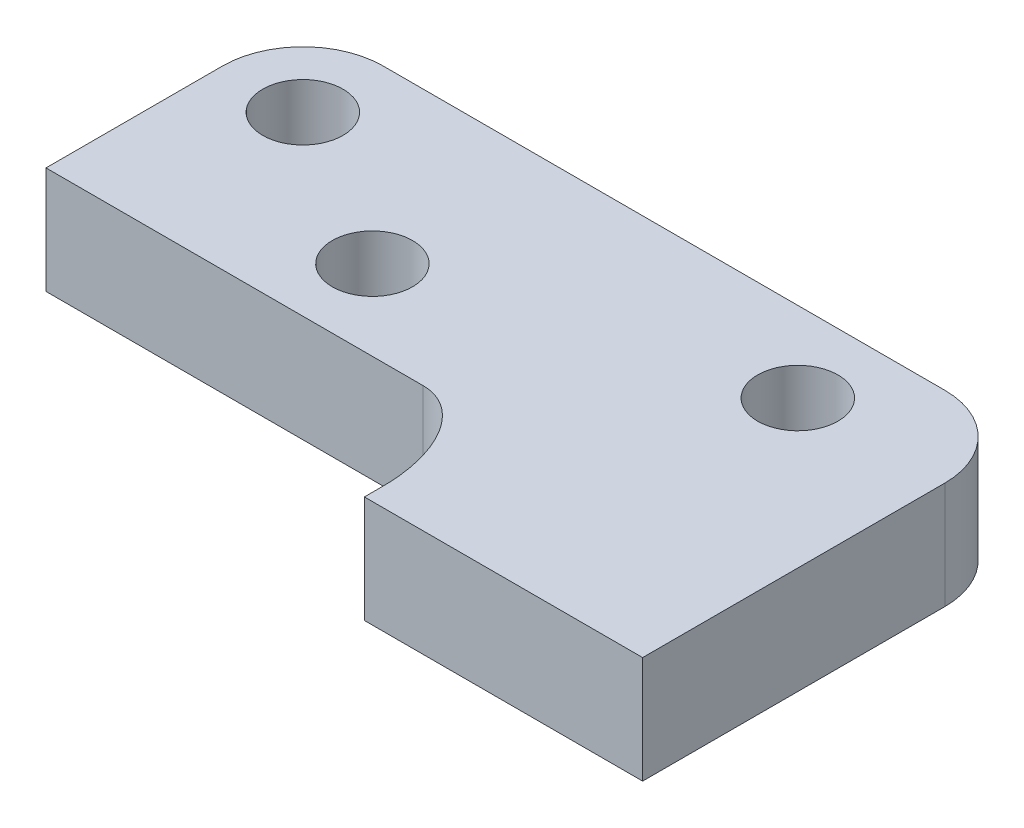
ISO-10303-21;
HEADER;
FILE_DESCRIPTION(('STEP AP214'),'2;1');
FILE_NAME('part.step','',(''),(''),'','','');
FILE_SCHEMA(('AUTOMOTIVE_DESIGN { 1 0 10303 214 1 1 1 1 }'));
ENDSEC;
DATA;
#1=APPLICATION_CONTEXT('core data for automotive mechanical design processes');
#2=APPLICATION_PROTOCOL_DEFINITION('international standard','automotive_design',2000,#1);
#3=PRODUCT_CONTEXT('',#1,'mechanical');
#4=PRODUCT('Part','Part','',(#3));
#5=PRODUCT_RELATED_PRODUCT_CATEGORY('part','',(#4));
#6=PRODUCT_DEFINITION_FORMATION('','',#4);
#7=PRODUCT_DEFINITION_CONTEXT('part definition',#1,'design');
#8=PRODUCT_DEFINITION('design','',#6,#7);
#9=PRODUCT_DEFINITION_SHAPE('','',#8);
#10=(LENGTH_UNIT() NAMED_UNIT(*) SI_UNIT(.MILLI.,.METRE.));
#11=(NAMED_UNIT(*) PLANE_ANGLE_UNIT() SI_UNIT($,.RADIAN.));
#12=(NAMED_UNIT(*) SI_UNIT($,.STERADIAN.) SOLID_ANGLE_UNIT());
#13=UNCERTAINTY_MEASURE_WITH_UNIT(LENGTH_MEASURE(1.E-05),#10,'distance_accuracy_value','');
#14=(GEOMETRIC_REPRESENTATION_CONTEXT(3) GLOBAL_UNCERTAINTY_ASSIGNED_CONTEXT((#13)) GLOBAL_UNIT_ASSIGNED_CONTEXT((#10,
#11,#12)) REPRESENTATION_CONTEXT('',''));
#15=CARTESIAN_POINT('',(0.,0.,0.));
#16=DIRECTION('',(0.,0.,1.));
#17=DIRECTION('',(1.,0.,0.));
#18=AXIS2_PLACEMENT_3D('',#15,#16,#17);
#19=CARTESIAN_POINT('',(4.35,-2.,-1.125));
#20=DIRECTION('',(-1.,0.,0.));
#21=DIRECTION('',(0.,0.,1.));
#22=AXIS2_PLACEMENT_3D('',#19,#20,#21);
#23=PLANE('',#22);
#24=CARTESIAN_POINT('',(4.35008091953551,-2.,-1.12499989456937));
#25=DIRECTION('',(0.,1.,0.));
#26=VECTOR('',#25,1.);
#27=LINE('',#24,#26);
#28=CARTESIAN_POINT('',(4.35004045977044,2.,-1.12499994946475));
#29=VERTEX_POINT('',#28);
#30=CARTESIAN_POINT('',(4.35004045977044,-2.,-1.12499994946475));
#31=VERTEX_POINT('',#30);
#32=EDGE_CURVE('E133',#29,#31,#27,.F.);
#33=ORIENTED_EDGE('',*,*,#32,.T.);
#34=DIRECTION('',(0.,0.,1.));
#35=VECTOR('',#34,1.);
#36=CARTESIAN_POINT('',(4.35,-2.,0.));
#37=LINE('',#36,#35);
#38=CARTESIAN_POINT('',(4.35,-2.,-0.425));
#39=VERTEX_POINT('',#38);
#40=EDGE_CURVE('E247',#31,#39,#37,.T.);
#41=ORIENTED_EDGE('',*,*,#40,.T.);
#42=DIRECTION('',(0.,1.,0.));
#43=VECTOR('',#42,1.);
#44=CARTESIAN_POINT('',(4.35,-2.,-0.425));
#45=LINE('',#44,#43);
#46=CARTESIAN_POINT('',(4.35,2.,-0.425));
#47=VERTEX_POINT('',#46);
#48=EDGE_CURVE('E131',#47,#39,#45,.F.);
#49=ORIENTED_EDGE('',*,*,#48,.F.);
#50=DIRECTION('',(0.,0.,1.));
#51=VECTOR('',#50,1.);
#52=CARTESIAN_POINT('',(4.35,2.,-1.125));
#53=LINE('',#52,#51);
#54=EDGE_CURVE('E100',#47,#29,#53,.F.);
#55=ORIENTED_EDGE('',*,*,#54,.T.);
#56=EDGE_LOOP('',(#33,#41,#49,#55));
#57=FACE_BOUND('',#56,.T.);
#58=ADVANCED_FACE('F17',(#57),#23,.T.);
#59=CARTESIAN_POINT('',(0.,-2.,0.));
#60=DIRECTION('',(0.,1.,0.));
#61=DIRECTION('',(0.,0.,1.));
#62=AXIS2_PLACEMENT_3D('',#59,#60,#61);
#63=PLANE('',#62);
#64=CARTESIAN_POINT('',(-3.05,-2.,-8.125));
#65=DIRECTION('',(0.,1.,0.));
#66=DIRECTION('',(0.,0.,1.));
#67=AXIS2_PLACEMENT_3D('',#64,#65,#66);
#68=CIRCLE('',#67,1.5);
#69=CARTESIAN_POINT('',(-3.05,-2.,-6.625));
#70=VERTEX_POINT('',#69);
#71=EDGE_CURVE('E221',#70,#70,#68,.T.);
#72=ORIENTED_EDGE('',*,*,#71,.T.);
#73=EDGE_LOOP('',(#72));
#74=FACE_BOUND('',#73,.T.);
#75=CARTESIAN_POINT('',(-9.25,-2.,-11.725));
#76=DIRECTION('',(0.,1.,0.));
#77=DIRECTION('',(0.,0.,1.));
#78=AXIS2_PLACEMENT_3D('',#75,#76,#77);
#79=CIRCLE('',#78,1.5);
#80=CARTESIAN_POINT('',(-9.25,-2.,-10.225));
#81=VERTEX_POINT('',#80);
#82=EDGE_CURVE('E368',#81,#81,#79,.T.);
#83=ORIENTED_EDGE('',*,*,#82,.T.);
#84=EDGE_LOOP('',(#83));
#85=FACE_BOUND('',#84,.T.);
#86=CARTESIAN_POINT('',(9.25,-2.,-11.725));
#87=DIRECTION('',(0.,1.,0.));
#88=DIRECTION('',(0.,0.,1.));
#89=AXIS2_PLACEMENT_3D('',#86,#87,#88);
#90=CIRCLE('',#89,1.5);
#91=CARTESIAN_POINT('',(9.25,-2.,-10.225));
#92=VERTEX_POINT('',#91);
#93=EDGE_CURVE('E267',#92,#92,#90,.T.);
#94=ORIENTED_EDGE('',*,*,#93,.T.);
#95=EDGE_LOOP('',(#94));
#96=FACE_BOUND('',#95,.T.);
#97=CARTESIAN_POINT('',(11.75,-2.,-11.725));
#98=DIRECTION('',(0.,1.,0.));
#99=DIRECTION('',(0.,0.,1.));
#100=AXIS2_PLACEMENT_3D('',#97,#98,#99);
#101=CIRCLE('',#100,3.);
#102=CARTESIAN_POINT('',(14.75,-2.,-11.725));
#103=VERTEX_POINT('',#102);
#104=CARTESIAN_POINT('',(11.75,-2.,-14.725));
#105=VERTEX_POINT('',#104);
#106=EDGE_CURVE('E233',#103,#105,#101,.T.);
#107=ORIENTED_EDGE('',*,*,#106,.F.);
#108=DIRECTION('',(0.,0.,-1.));
#109=VECTOR('',#108,1.);
#110=CARTESIAN_POINT('',(14.75,-2.,-0.425));
#111=LINE('',#110,#109);
#112=CARTESIAN_POINT('',(14.75,-2.,-0.425));
#113=VERTEX_POINT('',#112);
#114=EDGE_CURVE('E66',#113,#103,#111,.T.);
#115=ORIENTED_EDGE('',*,*,#114,.F.);
#116=DIRECTION('',(1.,0.,0.));
#117=VECTOR('',#116,1.);
#118=CARTESIAN_POINT('',(4.35,-2.,-0.425));
#119=LINE('',#118,#117);
#120=EDGE_CURVE('E76',#39,#113,#119,.T.);
#121=ORIENTED_EDGE('',*,*,#120,.F.);
#122=ORIENTED_EDGE('',*,*,#40,.F.);
#123=CARTESIAN_POINT('',(4.35008091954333,-2.,-1.12499990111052));
#124=CARTESIAN_POINT('',(4.35023973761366,-2.,-1.23796661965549));
#125=CARTESIAN_POINT('',(4.34750347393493,-2.,-1.35095608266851));
#126=CARTESIAN_POINT('',(4.33593330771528,-2.,-1.57684698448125));
#127=CARTESIAN_POINT('',(4.3270871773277,-2.,-1.68974779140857));
#128=CARTESIAN_POINT('',(4.30297655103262,-2.,-1.91496686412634));
#129=CARTESIAN_POINT('',(4.28770662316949,-2.,-2.0272845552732));
#130=CARTESIAN_POINT('',(4.25043635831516,-2.,-2.2521243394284));
#131=CARTESIAN_POINT('',(4.22836053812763,-2.,-2.36463389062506));
#132=CARTESIAN_POINT('',(4.17783080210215,-2.,-2.58814748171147));
#133=CARTESIAN_POINT('',(4.14938040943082,-2.,-2.69915231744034));
#134=CARTESIAN_POINT('',(4.08563637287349,-2.,-2.91911271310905));
#135=CARTESIAN_POINT('',(4.05034781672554,-2.,-3.02806973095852));
#136=CARTESIAN_POINT('',(3.97883042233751,-2.,-3.2252143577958));
#137=CARTESIAN_POINT('',(3.94375305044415,-2.,-3.3138190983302));
#138=CARTESIAN_POINT('',(3.86809085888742,-2.,-3.48865455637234));
#139=CARTESIAN_POINT('',(3.82750617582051,-2.,-3.57488533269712));
#140=CARTESIAN_POINT('',(3.74074328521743,-2.,-3.74420870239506));
#141=CARTESIAN_POINT('',(3.69458013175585,-2.,-3.82730898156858));
#142=CARTESIAN_POINT('',(3.59616160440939,-2.,-3.98982623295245));
#143=CARTESIAN_POINT('',(3.54390782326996,-2.,-4.06924416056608));
#144=CARTESIAN_POINT('',(3.44688591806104,-2.,-4.20392254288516));
#145=CARTESIAN_POINT('',(3.40355743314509,-2.,-4.26022083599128));
#146=CARTESIAN_POINT('',(3.31311905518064,-2.,-4.3696807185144));
#147=CARTESIAN_POINT('',(3.26601031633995,-2.,-4.42284325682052));
#148=CARTESIAN_POINT('',(3.16784943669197,-2.,-4.52534941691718));
#149=CARTESIAN_POINT('',(3.11680031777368,-2.,-4.57469590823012));
#150=CARTESIAN_POINT('',(3.03729013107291,-2.,-4.64538077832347));
#151=CARTESIAN_POINT('',(3.01029784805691,-2.,-4.66838619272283));
#152=CARTESIAN_POINT('',(2.95534563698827,-2.,-4.71321048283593));
#153=CARTESIAN_POINT('',(2.92738576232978,-2.,-4.73502942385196));
#154=CARTESIAN_POINT('',(2.85714472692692,-2.,-4.78719568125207));
#155=CARTESIAN_POINT('',(2.81427777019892,-2.,-4.81676275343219));
#156=CARTESIAN_POINT('',(2.72638479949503,-2.,-4.87248754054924));
#157=CARTESIAN_POINT('',(2.68135917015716,-2.,-4.89864585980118));
#158=CARTESIAN_POINT('',(2.58942071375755,-2.,-4.94710030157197));
#159=CARTESIAN_POINT('',(2.54251303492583,-2.,-4.96940617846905));
#160=CARTESIAN_POINT('',(2.44699524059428,-2.,-5.01003523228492));
#161=CARTESIAN_POINT('',(2.39838513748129,-2.,-5.02835843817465));
#162=CARTESIAN_POINT('',(2.30895155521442,-2.,-5.05749170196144));
#163=CARTESIAN_POINT('',(2.26837795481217,-2.,-5.06906635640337));
#164=CARTESIAN_POINT('',(2.20695277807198,-2.,-5.08409727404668));
#165=CARTESIAN_POINT('',(2.18638059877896,-2.,-5.08871956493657));
#166=CARTESIAN_POINT('',(2.14507698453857,-2.,-5.09719370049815));
#167=CARTESIAN_POINT('',(2.12434554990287,-2.,-5.1010455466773));
#168=CARTESIAN_POINT('',(2.08261108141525,-2.,-5.10794518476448));
#169=CARTESIAN_POINT('',(2.06160715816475,-2.,-5.11098761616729));
#170=CARTESIAN_POINT('',(2.01949081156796,-2.,-5.11619452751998));
#171=CARTESIAN_POINT('',(1.99837839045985,-2.,-5.11835902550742));
#172=CARTESIAN_POINT('',(1.95607311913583,-2.,-5.12179700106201));
#173=CARTESIAN_POINT('',(1.9348802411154,-2.,-5.12307013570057));
#174=CARTESIAN_POINT('',(1.89245768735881,-2.,-5.12473624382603));
#175=CARTESIAN_POINT('',(1.87122800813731,-2.,-5.12512912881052));
#176=CARTESIAN_POINT('',(1.84999984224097,-2.,-5.12508786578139));
#177=B_SPLINE_CURVE_WITH_KNOTS('',3,(#123,#124,#125,#126,#127,#128,#129,#130,#131,#132,#133,
#134,#135,#136,#137,#138,#139,#140,#141,#142,#143,#144,#145,#146,#147,#148,#149,#150,#151,#152,
#153,#154,#155,#156,#157,#158,#159,#160,#161,#162,#163,#164,#165,#166,#167,#168,#169,#170,#171,
#172,#173,#174,#175,#176),.UNSPECIFIED.,.F.,.F.,(4,2,2,2,2,2,2,2,2,2,2,2,2,2,2,2,2,2,2,2,2,2,2,
2,2,2,4),(0.,0.338891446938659,0.678463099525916,1.01832247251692,1.3620957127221,
1.70567941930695,2.04900846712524,2.33472494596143,2.62043433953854,2.90538924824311,
3.19026980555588,3.40324421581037,3.61615384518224,3.82890178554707,3.93527178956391,
4.04163593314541,4.19771271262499,4.35376178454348,4.5094097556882,4.66505659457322,
4.79150591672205,4.85474872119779,4.91799140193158,4.98164304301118,5.04529337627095,
5.10896818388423,5.17264939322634),.UNSPECIFIED.);
#178=CARTESIAN_POINT('',(1.8499999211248,-2.,-5.1250439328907));
#179=VERTEX_POINT('',#178);
#180=EDGE_CURVE('E198',#31,#179,#177,.T.);
#181=ORIENTED_EDGE('',*,*,#180,.T.);
#182=DIRECTION('',(1.,0.,0.));
#183=VECTOR('',#182,1.);
#184=CARTESIAN_POINT('',(-12.25,-2.,-5.125));
#185=LINE('',#184,#183);
#186=CARTESIAN_POINT('',(-12.25,-2.,-5.125));
#187=VERTEX_POINT('',#186);
#188=EDGE_CURVE('E191',#187,#179,#185,.T.);
#189=ORIENTED_EDGE('',*,*,#188,.F.);
#190=DIRECTION('',(0.,0.,1.));
#191=VECTOR('',#190,1.);
#192=CARTESIAN_POINT('',(-12.25,-2.,-11.725));
#193=LINE('',#192,#191);
#194=CARTESIAN_POINT('',(-12.25,-2.,-11.725));
#195=VERTEX_POINT('',#194);
#196=EDGE_CURVE('E253',#195,#187,#193,.T.);
#197=ORIENTED_EDGE('',*,*,#196,.F.);
#198=CARTESIAN_POINT('',(-9.25,-2.,-11.725));
#199=DIRECTION('',(0.,1.,0.));
#200=DIRECTION('',(0.,0.,1.));
#201=AXIS2_PLACEMENT_3D('',#198,#199,#200);
#202=CIRCLE('',#201,3.);
#203=CARTESIAN_POINT('',(-9.25,-2.,-14.725));
#204=VERTEX_POINT('',#203);
#205=EDGE_CURVE('E229',#204,#195,#202,.T.);
#206=ORIENTED_EDGE('',*,*,#205,.F.);
#207=DIRECTION('',(-1.,0.,0.));
#208=VECTOR('',#207,1.);
#209=CARTESIAN_POINT('',(11.75,-2.,-14.725));
#210=LINE('',#209,#208);
#211=EDGE_CURVE('E227',#105,#204,#210,.T.);
#212=ORIENTED_EDGE('',*,*,#211,.F.);
#213=EDGE_LOOP('',(#107,#115,#121,#122,#181,#189,#197,#206,#212));
#214=FACE_BOUND('',#213,.T.);
#215=ADVANCED_FACE('F265',(#74,#85,#96,#214),#63,.F.);
#216=CARTESIAN_POINT('',(-12.25,-2.,-11.725));
#217=DIRECTION('',(-1.,0.,0.));
#218=DIRECTION('',(0.,0.,1.));
#219=AXIS2_PLACEMENT_3D('',#216,#217,#218);
#220=PLANE('',#219);
#221=DIRECTION('',(0.,1.,0.));
#222=VECTOR('',#221,1.);
#223=CARTESIAN_POINT('',(-12.25,-2.,-11.725));
#224=LINE('',#223,#222);
#225=CARTESIAN_POINT('',(-12.25,2.,-11.725));
#226=VERTEX_POINT('',#225);
#227=EDGE_CURVE('E224',#195,#226,#224,.T.);
#228=ORIENTED_EDGE('',*,*,#227,.F.);
#229=ORIENTED_EDGE('',*,*,#196,.T.);
#230=DIRECTION('',(0.,1.,0.));
#231=VECTOR('',#230,1.);
#232=CARTESIAN_POINT('',(-12.25,-2.,-5.125));
#233=LINE('',#232,#231);
#234=CARTESIAN_POINT('',(-12.25,2.,-5.125));
#235=VERTEX_POINT('',#234);
#236=EDGE_CURVE('E140',#235,#187,#233,.F.);
#237=ORIENTED_EDGE('',*,*,#236,.F.);
#238=DIRECTION('',(0.,0.,1.));
#239=VECTOR('',#238,1.);
#240=CARTESIAN_POINT('',(-12.25,2.,0.));
#241=LINE('',#240,#239);
#242=EDGE_CURVE('E216',#226,#235,#241,.T.);
#243=ORIENTED_EDGE('',*,*,#242,.F.);
#244=EDGE_LOOP('',(#228,#229,#237,#243));
#245=FACE_BOUND('',#244,.T.);
#246=ADVANCED_FACE('F270',(#245),#220,.T.);
#247=CARTESIAN_POINT('',(-12.25,-2.,-5.125));
#248=DIRECTION('',(0.,0.,1.));
#249=DIRECTION('',(1.,0.,0.));
#250=AXIS2_PLACEMENT_3D('',#247,#248,#249);
#251=PLANE('',#250);
#252=ORIENTED_EDGE('',*,*,#236,.T.);
#253=ORIENTED_EDGE('',*,*,#188,.T.);
#254=CARTESIAN_POINT('',(1.84999984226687,2.,-5.12508786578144));
#255=DIRECTION('',(0.,-1.,0.));
#256=VECTOR('',#255,1.);
#257=LINE('',#254,#256);
#258=CARTESIAN_POINT('',(1.8499999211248,2.,-5.1250439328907));
#259=VERTEX_POINT('',#258);
#260=EDGE_CURVE('E186',#179,#259,#257,.F.);
#261=ORIENTED_EDGE('',*,*,#260,.T.);
#262=DIRECTION('',(1.,0.,0.));
#263=VECTOR('',#262,1.);
#264=CARTESIAN_POINT('',(0.,2.,-5.125));
#265=LINE('',#264,#263);
#266=EDGE_CURVE('E124',#235,#259,#265,.T.);
#267=ORIENTED_EDGE('',*,*,#266,.F.);
#268=EDGE_LOOP('',(#252,#253,#261,#267));
#269=FACE_BOUND('',#268,.T.);
#270=ADVANCED_FACE('F150',(#269),#251,.T.);
#271=CARTESIAN_POINT('',(4.348766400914,-2.,-0.9993569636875));
#272=CARTESIAN_POINT('',(4.360094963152,-2.,-1.57612607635));
#273=CARTESIAN_POINT('',(4.235347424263,-2.,-2.577678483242));
#274=CARTESIAN_POINT('',(3.854640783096,-2.,-3.597861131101));
#275=CARTESIAN_POINT('',(3.414815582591,-2.,-4.274543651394));
#276=CARTESIAN_POINT('',(3.00686813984,-2.,-4.701550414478));
#277=CARTESIAN_POINT('',(2.584626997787,-2.,-4.972547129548));
#278=CARTESIAN_POINT('',(2.165474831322,-2.,-5.105456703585));
#279=CARTESIAN_POINT('',(1.915511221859,-2.,-5.130268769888));
#280=CARTESIAN_POINT('',(1.771473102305,-2.,-5.123026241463));
#281=(BOUNDED_CURVE() B_SPLINE_CURVE(3,(#271,#272,#273,#274,#275,#276,#277,#278,#279,#280),
.UNSPECIFIED.,.F.,.F.) B_SPLINE_CURVE_WITH_KNOTS((4,1,1,1,1,1,1,4),(0.,0.25,0.5,0.625,0.75,
0.875,0.9375,1.),
.UNSPECIFIED.) CURVE() GEOMETRIC_REPRESENTATION_ITEM() RATIONAL_B_SPLINE_CURVE((1.,1.,1.,1.,1.,
1.,1.,1.,1.,1.)) REPRESENTATION_ITEM(''));
#282=DIRECTION('',(0.,1.,0.));
#283=VECTOR('',#282,1.);
#284=SURFACE_OF_LINEAR_EXTRUSION('',#281,#283);
#285=CARTESIAN_POINT('',(1.84999984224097,2.,-5.12508786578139));
#286=CARTESIAN_POINT('',(1.87365343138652,2.,-5.12513561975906));
#287=CARTESIAN_POINT('',(1.89730865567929,2.,-5.12464186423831));
#288=CARTESIAN_POINT('',(1.94456588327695,2.,-5.12255961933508));
#289=CARTESIAN_POINT('',(1.96816789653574,2.,-5.12097135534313));
#290=CARTESIAN_POINT('',(2.01524737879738,2.,-5.11669064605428));
#291=CARTESIAN_POINT('',(2.03872495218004,2.,-5.11399935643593));
#292=CARTESIAN_POINT('',(2.08552970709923,2.,-5.107536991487));
#293=CARTESIAN_POINT('',(2.10885687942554,2.,-5.1037658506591));
#294=CARTESIAN_POINT('',(2.17819221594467,2.,-5.09103441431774));
#295=CARTESIAN_POINT('',(2.22394158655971,2.,-5.08061848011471));
#296=CARTESIAN_POINT('',(2.31441035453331,2.,-5.05598274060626));
#297=CARTESIAN_POINT('',(2.3591294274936,2.,-5.04176175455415));
#298=CARTESIAN_POINT('',(2.44713706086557,2.,-5.00986445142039));
#299=CARTESIAN_POINT('',(2.49043002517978,2.,-4.99220022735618));
#300=CARTESIAN_POINT('',(2.57556887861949,2.,-4.953700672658));
#301=CARTESIAN_POINT('',(2.61741504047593,2.,-4.9328659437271));
#302=CARTESIAN_POINT('',(2.69954144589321,2.,-4.8881321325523));
#303=CARTESIAN_POINT('',(2.73981840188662,2.,-4.86422702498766));
#304=CARTESIAN_POINT('',(2.81862730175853,2.,-4.81368357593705));
#305=CARTESIAN_POINT('',(2.85715880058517,2.,-4.78704454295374));
#306=CARTESIAN_POINT('',(2.92462539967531,2.,-4.73717787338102));
#307=CARTESIAN_POINT('',(2.95388996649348,2.,-4.71439264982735));
#308=CARTESIAN_POINT('',(3.01136116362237,2.,-4.66752406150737));
#309=CARTESIAN_POINT('',(3.03956769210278,2.,-4.64344057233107));
#310=CARTESIAN_POINT('',(3.12258707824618,2.,-4.56936612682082));
#311=CARTESIAN_POINT('',(3.17579245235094,2.,-4.51755663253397));
#312=CARTESIAN_POINT('',(3.27794944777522,2.,-4.40976499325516));
#313=CARTESIAN_POINT('',(3.32689347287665,2.,-4.35377571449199));
#314=CARTESIAN_POINT('',(3.42066783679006,2.,-4.23843606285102));
#315=CARTESIAN_POINT('',(3.46549664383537,2.,-4.17908445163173));
#316=CARTESIAN_POINT('',(3.57380729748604,2.,-4.02547389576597));
#317=CARTESIAN_POINT('',(3.63463275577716,2.,-3.92933755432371));
#318=CARTESIAN_POINT('',(3.74782620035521,2.,-3.73220904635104));
#319=CARTESIAN_POINT('',(3.80019004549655,2.,-3.63121453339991));
#320=CARTESIAN_POINT('',(3.89708667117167,2.,-3.42514965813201));
#321=CARTESIAN_POINT('',(3.94159334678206,2.,-3.32006707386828));
#322=CARTESIAN_POINT('',(4.02302681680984,2.,-3.10702800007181));
#323=CARTESIAN_POINT('',(4.05995388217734,2.,-2.99907161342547));
#324=CARTESIAN_POINT('',(4.12272725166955,2.,-2.79435747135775));
#325=CARTESIAN_POINT('',(4.14937612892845,2.,-2.69784282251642));
#326=CARTESIAN_POINT('',(4.19776025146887,2.,-2.50356565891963));
#327=CARTESIAN_POINT('',(4.21949421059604,2.,-2.40580282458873));
#328=CARTESIAN_POINT('',(4.2579633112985,2.,-2.20927672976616));
#329=CARTESIAN_POINT('',(4.27469745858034,2.,-2.11051327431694));
#330=CARTESIAN_POINT('',(4.30290724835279,2.,-1.91353037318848));
#331=CARTESIAN_POINT('',(4.31444751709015,2.,-1.81532016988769));
#332=CARTESIAN_POINT('',(4.33268212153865,2.,-1.61848539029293));
#333=CARTESIAN_POINT('',(4.33937791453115,2.,-1.51986094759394));
#334=CARTESIAN_POINT('',(4.3481407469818,2.,-1.32248597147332));
#335=CARTESIAN_POINT('',(4.3502115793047,2.,-1.2237356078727));
#336=CARTESIAN_POINT('',(4.35008091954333,2.,-1.12499990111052));
#337=B_SPLINE_CURVE_WITH_KNOTS('',3,(#285,#286,#287,#288,#289,#290,#291,#292,#293,#294,#295,
#296,#297,#298,#299,#300,#301,#302,#303,#304,#305,#306,#307,#308,#309,#310,#311,#312,#313,#314,
#315,#316,#317,#318,#319,#320,#321,#322,#323,#324,#325,#326,#327,#328,#329,#330,#331,#332,#333,
#334,#335,#336),.UNSPECIFIED.,.F.,.F.,(4,2,2,2,2,2,2,2,2,2,2,2,2,2,2,2,2,2,2,2,2,2,2,2,2,4),(0.,
0.0709554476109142,0.141896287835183,0.212762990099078,0.283633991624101,0.424212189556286,
0.56483406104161,0.704970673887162,0.845080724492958,0.985470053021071,1.1258949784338,
1.23712118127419,1.34835806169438,1.57085900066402,1.79374877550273,2.01672118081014,
2.3574823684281,2.69840982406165,3.04044950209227,3.38247695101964,3.68272027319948,
3.98304207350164,4.28342355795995,4.57995648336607,4.87640017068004,5.17260065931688),.UNSPECIFIED.);
#338=EDGE_CURVE('E122',#259,#29,#337,.T.);
#339=ORIENTED_EDGE('',*,*,#338,.F.);
#340=ORIENTED_EDGE('',*,*,#260,.F.);
#341=ORIENTED_EDGE('',*,*,#180,.F.);
#342=ORIENTED_EDGE('',*,*,#32,.F.);
#343=EDGE_LOOP('',(#339,#340,#341,#342));
#344=FACE_BOUND('',#343,.T.);
#345=ADVANCED_FACE('F145',(#344),#284,.F.);
#346=CARTESIAN_POINT('',(4.35,-2.,-0.425));
#347=DIRECTION('',(0.,0.,1.));
#348=DIRECTION('',(1.,0.,0.));
#349=AXIS2_PLACEMENT_3D('',#346,#347,#348);
#350=PLANE('',#349);
#351=ORIENTED_EDGE('',*,*,#48,.T.);
#352=ORIENTED_EDGE('',*,*,#120,.T.);
#353=DIRECTION('',(0.,1.,0.));
#354=VECTOR('',#353,1.);
#355=CARTESIAN_POINT('',(14.75,-2.,-0.425));
#356=LINE('',#355,#354);
#357=CARTESIAN_POINT('',(14.75,2.,-0.425));
#358=VERTEX_POINT('',#357);
#359=EDGE_CURVE('E106',#358,#113,#356,.F.);
#360=ORIENTED_EDGE('',*,*,#359,.F.);
#361=DIRECTION('',(1.,0.,0.));
#362=VECTOR('',#361,1.);
#363=CARTESIAN_POINT('',(0.,2.,-0.425));
#364=LINE('',#363,#362);
#365=EDGE_CURVE('E109',#47,#358,#364,.T.);
#366=ORIENTED_EDGE('',*,*,#365,.F.);
#367=EDGE_LOOP('',(#351,#352,#360,#366));
#368=FACE_BOUND('',#367,.T.);
#369=ADVANCED_FACE('F108',(#368),#350,.T.);
#370=CARTESIAN_POINT('',(14.75,-2.,-0.425));
#371=DIRECTION('',(1.,0.,0.));
#372=DIRECTION('',(0.,0.,-1.));
#373=AXIS2_PLACEMENT_3D('',#370,#371,#372);
#374=PLANE('',#373);
#375=ORIENTED_EDGE('',*,*,#359,.T.);
#376=ORIENTED_EDGE('',*,*,#114,.T.);
#377=DIRECTION('',(0.,1.,0.));
#378=VECTOR('',#377,1.);
#379=CARTESIAN_POINT('',(14.75,-2.,-11.725));
#380=LINE('',#379,#378);
#381=CARTESIAN_POINT('',(14.75,2.,-11.725));
#382=VERTEX_POINT('',#381);
#383=EDGE_CURVE('E115',#382,#103,#380,.F.);
#384=ORIENTED_EDGE('',*,*,#383,.F.);
#385=DIRECTION('',(0.,0.,1.));
#386=VECTOR('',#385,1.);
#387=CARTESIAN_POINT('',(14.75,2.,0.));
#388=LINE('',#387,#386);
#389=EDGE_CURVE('E112',#358,#382,#388,.F.);
#390=ORIENTED_EDGE('',*,*,#389,.F.);
#391=EDGE_LOOP('',(#375,#376,#384,#390));
#392=FACE_BOUND('',#391,.T.);
#393=ADVANCED_FACE('F113',(#392),#374,.T.);
#394=CARTESIAN_POINT('',(11.75,-2.,-11.725));
#395=DIRECTION('',(0.,1.,0.));
#396=DIRECTION('',(0.,0.,1.));
#397=AXIS2_PLACEMENT_3D('',#394,#395,#396);
#398=CYLINDRICAL_SURFACE('',#397,3.);
#399=ORIENTED_EDGE('',*,*,#383,.T.);
#400=ORIENTED_EDGE('',*,*,#106,.T.);
#401=DIRECTION('',(0.,1.,0.));
#402=VECTOR('',#401,1.);
#403=CARTESIAN_POINT('',(11.75,-2.,-14.725));
#404=LINE('',#403,#402);
#405=CARTESIAN_POINT('',(11.75,2.,-14.725));
#406=VERTEX_POINT('',#405);
#407=EDGE_CURVE('E230',#406,#105,#404,.F.);
#408=ORIENTED_EDGE('',*,*,#407,.F.);
#409=CARTESIAN_POINT('',(11.75,2.,-11.725));
#410=DIRECTION('',(0.,1.,0.));
#411=DIRECTION('',(0.,0.,1.));
#412=AXIS2_PLACEMENT_3D('',#409,#410,#411);
#413=CIRCLE('',#412,3.);
#414=EDGE_CURVE('E118',#382,#406,#413,.T.);
#415=ORIENTED_EDGE('',*,*,#414,.F.);
#416=EDGE_LOOP('',(#399,#400,#408,#415));
#417=FACE_BOUND('',#416,.T.);
#418=ADVANCED_FACE('F301',(#417),#398,.T.);
#419=CARTESIAN_POINT('',(11.75,-2.,-14.725));
#420=DIRECTION('',(0.,0.,-1.));
#421=DIRECTION('',(-1.,0.,0.));
#422=AXIS2_PLACEMENT_3D('',#419,#420,#421);
#423=PLANE('',#422);
#424=ORIENTED_EDGE('',*,*,#407,.T.);
#425=ORIENTED_EDGE('',*,*,#211,.T.);
#426=DIRECTION('',(0.,1.,0.));
#427=VECTOR('',#426,1.);
#428=CARTESIAN_POINT('',(-9.25,-2.,-14.725));
#429=LINE('',#428,#427);
#430=CARTESIAN_POINT('',(-9.25,2.,-14.725));
#431=VERTEX_POINT('',#430);
#432=EDGE_CURVE('E40',#431,#204,#429,.F.);
#433=ORIENTED_EDGE('',*,*,#432,.F.);
#434=DIRECTION('',(1.,0.,0.));
#435=VECTOR('',#434,1.);
#436=CARTESIAN_POINT('',(0.,2.,-14.725));
#437=LINE('',#436,#435);
#438=EDGE_CURVE('E209',#406,#431,#437,.F.);
#439=ORIENTED_EDGE('',*,*,#438,.F.);
#440=EDGE_LOOP('',(#424,#425,#433,#439));
#441=FACE_BOUND('',#440,.T.);
#442=ADVANCED_FACE('F262',(#441),#423,.T.);
#443=CARTESIAN_POINT('',(-9.25,-2.,-11.725));
#444=DIRECTION('',(0.,1.,0.));
#445=DIRECTION('',(0.,0.,1.));
#446=AXIS2_PLACEMENT_3D('',#443,#444,#445);
#447=CYLINDRICAL_SURFACE('',#446,3.);
#448=ORIENTED_EDGE('',*,*,#432,.T.);
#449=ORIENTED_EDGE('',*,*,#205,.T.);
#450=ORIENTED_EDGE('',*,*,#227,.T.);
#451=CARTESIAN_POINT('',(-9.25,2.,-11.725));
#452=DIRECTION('',(0.,1.,0.));
#453=DIRECTION('',(0.,0.,1.));
#454=AXIS2_PLACEMENT_3D('',#451,#452,#453);
#455=CIRCLE('',#454,3.);
#456=EDGE_CURVE('E206',#431,#226,#455,.T.);
#457=ORIENTED_EDGE('',*,*,#456,.F.);
#458=EDGE_LOOP('',(#448,#449,#450,#457));
#459=FACE_BOUND('',#458,.T.);
#460=ADVANCED_FACE('F269',(#459),#447,.T.);
#461=CARTESIAN_POINT('',(9.25,-2.,-11.725));
#462=DIRECTION('',(0.,1.,0.));
#463=DIRECTION('',(0.,0.,1.));
#464=AXIS2_PLACEMENT_3D('',#461,#462,#463);
#465=CYLINDRICAL_SURFACE('',#464,1.5);
#466=CARTESIAN_POINT('',(9.25,2.,-11.725));
#467=DIRECTION('',(0.,1.,0.));
#468=DIRECTION('',(0.,0.,1.));
#469=AXIS2_PLACEMENT_3D('',#466,#467,#468);
#470=CIRCLE('',#469,1.5);
#471=CARTESIAN_POINT('',(9.25,2.,-10.225));
#472=VERTEX_POINT('',#471);
#473=EDGE_CURVE('E203',#472,#472,#470,.F.);
#474=ORIENTED_EDGE('',*,*,#473,.F.);
#475=EDGE_LOOP('',(#474));
#476=FACE_BOUND('',#475,.T.);
#477=ORIENTED_EDGE('',*,*,#93,.F.);
#478=EDGE_LOOP('',(#477));
#479=FACE_BOUND('',#478,.T.);
#480=ADVANCED_FACE('F292',(#476,#479),#465,.F.);
#481=CARTESIAN_POINT('',(-9.25,-2.,-11.725));
#482=DIRECTION('',(0.,1.,0.));
#483=DIRECTION('',(0.,0.,1.));
#484=AXIS2_PLACEMENT_3D('',#481,#482,#483);
#485=CYLINDRICAL_SURFACE('',#484,1.5);
#486=CARTESIAN_POINT('',(-9.25,2.,-11.725));
#487=DIRECTION('',(0.,1.,0.));
#488=DIRECTION('',(0.,0.,1.));
#489=AXIS2_PLACEMENT_3D('',#486,#487,#488);
#490=CIRCLE('',#489,1.5);
#491=CARTESIAN_POINT('',(-9.25,2.,-10.225));
#492=VERTEX_POINT('',#491);
#493=EDGE_CURVE('E31',#492,#492,#490,.F.);
#494=ORIENTED_EDGE('',*,*,#493,.F.);
#495=EDGE_LOOP('',(#494));
#496=FACE_BOUND('',#495,.T.);
#497=ORIENTED_EDGE('',*,*,#82,.F.);
#498=EDGE_LOOP('',(#497));
#499=FACE_BOUND('',#498,.T.);
#500=ADVANCED_FACE('F284',(#496,#499),#485,.F.);
#501=CARTESIAN_POINT('',(-3.05,-2.,-8.125));
#502=DIRECTION('',(0.,1.,0.));
#503=DIRECTION('',(0.,0.,1.));
#504=AXIS2_PLACEMENT_3D('',#501,#502,#503);
#505=CYLINDRICAL_SURFACE('',#504,1.5);
#506=CARTESIAN_POINT('',(-3.05,2.,-8.125));
#507=DIRECTION('',(0.,1.,0.));
#508=DIRECTION('',(0.,0.,1.));
#509=AXIS2_PLACEMENT_3D('',#506,#507,#508);
#510=CIRCLE('',#509,1.5);
#511=CARTESIAN_POINT('',(-3.05,2.,-6.625));
#512=VERTEX_POINT('',#511);
#513=EDGE_CURVE('E11',#512,#512,#510,.F.);
#514=ORIENTED_EDGE('',*,*,#513,.F.);
#515=EDGE_LOOP('',(#514));
#516=FACE_BOUND('',#515,.T.);
#517=ORIENTED_EDGE('',*,*,#71,.F.);
#518=EDGE_LOOP('',(#517));
#519=FACE_BOUND('',#518,.T.);
#520=ADVANCED_FACE('F279',(#516,#519),#505,.F.);
#521=CARTESIAN_POINT('',(0.,2.,0.));
#522=DIRECTION('',(0.,1.,0.));
#523=DIRECTION('',(0.,0.,1.));
#524=AXIS2_PLACEMENT_3D('',#521,#522,#523);
#525=PLANE('',#524);
#526=ORIENTED_EDGE('',*,*,#513,.T.);
#527=EDGE_LOOP('',(#526));
#528=FACE_BOUND('',#527,.T.);
#529=ORIENTED_EDGE('',*,*,#493,.T.);
#530=EDGE_LOOP('',(#529));
#531=FACE_BOUND('',#530,.T.);
#532=ORIENTED_EDGE('',*,*,#473,.T.);
#533=EDGE_LOOP('',(#532));
#534=FACE_BOUND('',#533,.T.);
#535=ORIENTED_EDGE('',*,*,#438,.T.);
#536=ORIENTED_EDGE('',*,*,#456,.T.);
#537=ORIENTED_EDGE('',*,*,#242,.T.);
#538=ORIENTED_EDGE('',*,*,#266,.T.);
#539=ORIENTED_EDGE('',*,*,#338,.T.);
#540=ORIENTED_EDGE('',*,*,#54,.F.);
#541=ORIENTED_EDGE('',*,*,#365,.T.);
#542=ORIENTED_EDGE('',*,*,#389,.T.);
#543=ORIENTED_EDGE('',*,*,#414,.T.);
#544=EDGE_LOOP('',(#535,#536,#537,#538,#539,#540,#541,#542,#543));
#545=FACE_BOUND('',#544,.T.);
#546=ADVANCED_FACE('F121',(#528,#531,#534,#545),#525,.T.);
#547=CLOSED_SHELL('',(#58,#215,#246,#270,#345,#369,#393,#418,#442,#460,#480,#500,#520,#546));
#548=MANIFOLD_SOLID_BREP('B1',#547);
#549=ADVANCED_BREP_SHAPE_REPRESENTATION('',(#18,#548),#14);
#550=SHAPE_DEFINITION_REPRESENTATION(#9,#549);
ENDSEC;
END-ISO-10303-21;
